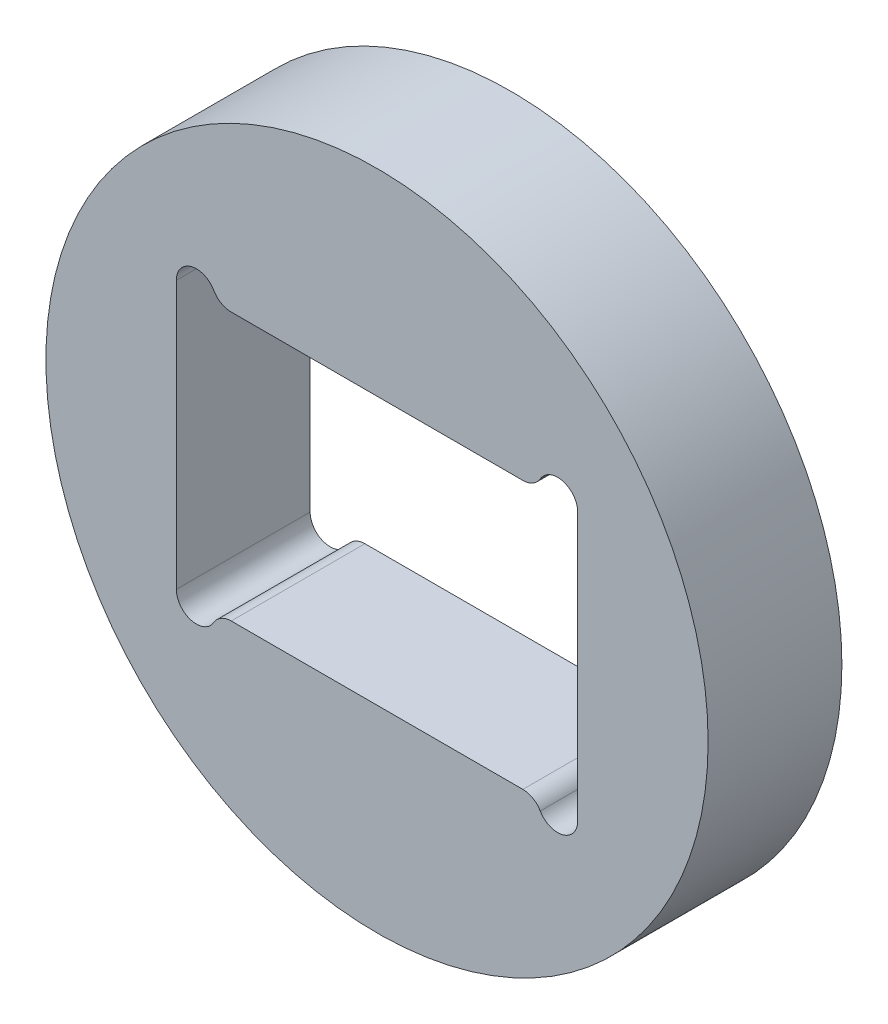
ISO-10303-21;
HEADER;
FILE_DESCRIPTION(('STEP AP214'),'2;1');
FILE_NAME('part.step','',(''),(''),'','','');
FILE_SCHEMA(('AUTOMOTIVE_DESIGN { 1 0 10303 214 1 1 1 1 }'));
ENDSEC;
DATA;
#1=APPLICATION_CONTEXT('core data for automotive mechanical design processes');
#2=APPLICATION_PROTOCOL_DEFINITION('international standard','automotive_design',2000,#1);
#3=PRODUCT_CONTEXT('',#1,'mechanical');
#4=PRODUCT('Part','Part','',(#3));
#5=PRODUCT_RELATED_PRODUCT_CATEGORY('part','',(#4));
#6=PRODUCT_DEFINITION_FORMATION('','',#4);
#7=PRODUCT_DEFINITION_CONTEXT('part definition',#1,'design');
#8=PRODUCT_DEFINITION('design','',#6,#7);
#9=PRODUCT_DEFINITION_SHAPE('','',#8);
#10=(LENGTH_UNIT() NAMED_UNIT(*) SI_UNIT(.MILLI.,.METRE.));
#11=(NAMED_UNIT(*) PLANE_ANGLE_UNIT() SI_UNIT($,.RADIAN.));
#12=(NAMED_UNIT(*) SI_UNIT($,.STERADIAN.) SOLID_ANGLE_UNIT());
#13=UNCERTAINTY_MEASURE_WITH_UNIT(LENGTH_MEASURE(1.E-05),#10,'distance_accuracy_value','');
#14=(GEOMETRIC_REPRESENTATION_CONTEXT(3) GLOBAL_UNCERTAINTY_ASSIGNED_CONTEXT((#13)) GLOBAL_UNIT_ASSIGNED_CONTEXT((#10,
#11,#12)) REPRESENTATION_CONTEXT('',''));
#15=CARTESIAN_POINT('',(0.,0.,0.));
#16=DIRECTION('',(0.,0.,1.));
#17=DIRECTION('',(1.,0.,0.));
#18=AXIS2_PLACEMENT_3D('',#15,#16,#17);
#19=CARTESIAN_POINT('',(0.,0.,10.));
#20=DIRECTION('',(0.,0.,1.));
#21=DIRECTION('',(1.,0.,0.));
#22=AXIS2_PLACEMENT_3D('',#19,#20,#21);
#23=PLANE('',#22);
#24=CARTESIAN_POINT('',(0.,0.,10.));
#25=DIRECTION('',(0.,0.,1.));
#26=DIRECTION('',(1.,0.,0.));
#27=AXIS2_PLACEMENT_3D('',#24,#25,#26);
#28=CIRCLE('',#27,24.75);
#29=CARTESIAN_POINT('',(24.75,0.,10.));
#30=VERTEX_POINT('',#29);
#31=EDGE_CURVE('E11',#30,#30,#28,.T.);
#32=ORIENTED_EDGE('',*,*,#31,.T.);
#33=EDGE_LOOP('',(#32));
#34=FACE_BOUND('',#33,.T.);
#35=DIRECTION('',(0.,-1.,0.));
#36=VECTOR('',#35,1.);
#37=CARTESIAN_POINT('',(-15.,-10.0000000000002,10.));
#38=LINE('',#37,#36);
#39=CARTESIAN_POINT('',(-15.,10.,10.));
#40=VERTEX_POINT('',#39);
#41=CARTESIAN_POINT('',(-15.,-10.0000000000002,10.));
#42=VERTEX_POINT('',#41);
#43=EDGE_CURVE('E144',#40,#42,#38,.T.);
#44=ORIENTED_EDGE('',*,*,#43,.F.);
#45=CARTESIAN_POINT('',(-13.5,10.,10.));
#46=DIRECTION('',(0.,0.,1.));
#47=DIRECTION('',(1.,0.,0.));
#48=AXIS2_PLACEMENT_3D('',#45,#46,#47);
#49=CIRCLE('',#48,1.5);
#50=CARTESIAN_POINT('',(-12.2009618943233,10.75,10.));
#51=VERTEX_POINT('',#50);
#52=EDGE_CURVE('E135',#51,#40,#49,.T.);
#53=ORIENTED_EDGE('',*,*,#52,.F.);
#54=CARTESIAN_POINT('',(-10.9019237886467,11.5,10.));
#55=DIRECTION('',(0.,0.,-1.));
#56=DIRECTION('',(1.,0.,0.));
#57=AXIS2_PLACEMENT_3D('',#54,#55,#56);
#58=CIRCLE('',#57,1.5);
#59=CARTESIAN_POINT('',(-10.9019237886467,10.,10.));
#60=VERTEX_POINT('',#59);
#61=EDGE_CURVE('E187',#60,#51,#58,.T.);
#62=ORIENTED_EDGE('',*,*,#61,.F.);
#63=DIRECTION('',(-1.,0.,0.));
#64=VECTOR('',#63,1.);
#65=CARTESIAN_POINT('',(-10.9019237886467,10.,10.));
#66=LINE('',#65,#64);
#67=CARTESIAN_POINT('',(10.9019237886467,10.,10.));
#68=VERTEX_POINT('',#67);
#69=EDGE_CURVE('E184',#68,#60,#66,.T.);
#70=ORIENTED_EDGE('',*,*,#69,.F.);
#71=CARTESIAN_POINT('',(10.9019237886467,11.5,10.));
#72=DIRECTION('',(0.,0.,-1.));
#73=DIRECTION('',(1.,0.,0.));
#74=AXIS2_PLACEMENT_3D('',#71,#72,#73);
#75=CIRCLE('',#74,1.5);
#76=CARTESIAN_POINT('',(12.2009618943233,10.75,10.));
#77=VERTEX_POINT('',#76);
#78=EDGE_CURVE('E181',#77,#68,#75,.T.);
#79=ORIENTED_EDGE('',*,*,#78,.F.);
#80=CARTESIAN_POINT('',(13.5,10.,10.));
#81=DIRECTION('',(0.,0.,1.));
#82=DIRECTION('',(1.,0.,0.));
#83=AXIS2_PLACEMENT_3D('',#80,#81,#82);
#84=CIRCLE('',#83,1.5);
#85=CARTESIAN_POINT('',(15.,10.,10.));
#86=VERTEX_POINT('',#85);
#87=EDGE_CURVE('E178',#86,#77,#84,.T.);
#88=ORIENTED_EDGE('',*,*,#87,.F.);
#89=DIRECTION('',(0.,1.,0.));
#90=VECTOR('',#89,1.);
#91=CARTESIAN_POINT('',(15.,10.,10.));
#92=LINE('',#91,#90);
#93=CARTESIAN_POINT('',(15.,-10.0000000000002,10.));
#94=VERTEX_POINT('',#93);
#95=EDGE_CURVE('E175',#94,#86,#92,.T.);
#96=ORIENTED_EDGE('',*,*,#95,.F.);
#97=CARTESIAN_POINT('',(13.5,-10.0000000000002,10.));
#98=DIRECTION('',(0.,0.,1.));
#99=DIRECTION('',(1.,0.,0.));
#100=AXIS2_PLACEMENT_3D('',#97,#98,#99);
#101=CIRCLE('',#100,1.5);
#102=CARTESIAN_POINT('',(12.2009618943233,-10.7500000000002,10.));
#103=VERTEX_POINT('',#102);
#104=EDGE_CURVE('E172',#103,#94,#101,.T.);
#105=ORIENTED_EDGE('',*,*,#104,.F.);
#106=CARTESIAN_POINT('',(10.9019237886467,-11.5000000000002,10.));
#107=DIRECTION('',(0.,0.,-1.));
#108=DIRECTION('',(1.,0.,0.));
#109=AXIS2_PLACEMENT_3D('',#106,#107,#108);
#110=CIRCLE('',#109,1.5);
#111=CARTESIAN_POINT('',(10.9019237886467,-10.0000000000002,10.));
#112=VERTEX_POINT('',#111);
#113=EDGE_CURVE('E169',#112,#103,#110,.T.);
#114=ORIENTED_EDGE('',*,*,#113,.F.);
#115=DIRECTION('',(1.,0.,0.));
#116=VECTOR('',#115,1.);
#117=CARTESIAN_POINT('',(10.9019237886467,-10.0000000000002,10.));
#118=LINE('',#117,#116);
#119=CARTESIAN_POINT('',(-10.9019237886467,-10.0000000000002,10.));
#120=VERTEX_POINT('',#119);
#121=EDGE_CURVE('E166',#120,#112,#118,.T.);
#122=ORIENTED_EDGE('',*,*,#121,.F.);
#123=CARTESIAN_POINT('',(-10.9019237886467,-11.5000000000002,10.));
#124=DIRECTION('',(0.,0.,-1.));
#125=DIRECTION('',(1.,0.,0.));
#126=AXIS2_PLACEMENT_3D('',#123,#124,#125);
#127=CIRCLE('',#126,1.5);
#128=CARTESIAN_POINT('',(-12.2009618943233,-10.7500000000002,10.));
#129=VERTEX_POINT('',#128);
#130=EDGE_CURVE('E161',#129,#120,#127,.T.);
#131=ORIENTED_EDGE('',*,*,#130,.F.);
#132=CARTESIAN_POINT('',(-13.5,-10.0000000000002,10.));
#133=DIRECTION('',(0.,0.,1.));
#134=DIRECTION('',(1.,0.,0.));
#135=AXIS2_PLACEMENT_3D('',#132,#133,#134);
#136=CIRCLE('',#135,1.5);
#137=EDGE_CURVE('E157',#42,#129,#136,.T.);
#138=ORIENTED_EDGE('',*,*,#137,.F.);
#139=EDGE_LOOP('',(#44,#53,#62,#70,#79,#88,#96,#105,#114,#122,#131,#138));
#140=FACE_BOUND('',#139,.T.);
#141=ADVANCED_FACE('F45',(#34,#140),#23,.T.);
#142=CARTESIAN_POINT('',(0.,0.,0.));
#143=DIRECTION('',(0.,0.,1.));
#144=DIRECTION('',(1.,0.,0.));
#145=AXIS2_PLACEMENT_3D('',#142,#143,#144);
#146=PLANE('',#145);
#147=CARTESIAN_POINT('',(0.,0.,0.));
#148=DIRECTION('',(0.,0.,1.));
#149=DIRECTION('',(1.,0.,0.));
#150=AXIS2_PLACEMENT_3D('',#147,#148,#149);
#151=CIRCLE('',#150,24.75);
#152=CARTESIAN_POINT('',(24.75,0.,0.));
#153=VERTEX_POINT('',#152);
#154=EDGE_CURVE('E49',#153,#153,#151,.T.);
#155=ORIENTED_EDGE('',*,*,#154,.F.);
#156=EDGE_LOOP('',(#155));
#157=FACE_BOUND('',#156,.T.);
#158=CARTESIAN_POINT('',(-13.5,10.,0.));
#159=DIRECTION('',(0.,0.,1.));
#160=DIRECTION('',(1.,0.,0.));
#161=AXIS2_PLACEMENT_3D('',#158,#159,#160);
#162=CIRCLE('',#161,1.5);
#163=CARTESIAN_POINT('',(-12.2009618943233,10.75,0.));
#164=VERTEX_POINT('',#163);
#165=CARTESIAN_POINT('',(-15.,10.,0.));
#166=VERTEX_POINT('',#165);
#167=EDGE_CURVE('E69',#164,#166,#162,.T.);
#168=ORIENTED_EDGE('',*,*,#167,.T.);
#169=DIRECTION('',(0.,-1.,0.));
#170=VECTOR('',#169,1.);
#171=CARTESIAN_POINT('',(-15.,-10.0000000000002,0.));
#172=LINE('',#171,#170);
#173=CARTESIAN_POINT('',(-15.,-10.0000000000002,0.));
#174=VERTEX_POINT('',#173);
#175=EDGE_CURVE('E151',#166,#174,#172,.T.);
#176=ORIENTED_EDGE('',*,*,#175,.T.);
#177=CARTESIAN_POINT('',(-13.5,-10.0000000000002,0.));
#178=DIRECTION('',(0.,0.,1.));
#179=DIRECTION('',(1.,0.,0.));
#180=AXIS2_PLACEMENT_3D('',#177,#178,#179);
#181=CIRCLE('',#180,1.5);
#182=CARTESIAN_POINT('',(-12.2009618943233,-10.7500000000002,0.));
#183=VERTEX_POINT('',#182);
#184=EDGE_CURVE('E194',#174,#183,#181,.T.);
#185=ORIENTED_EDGE('',*,*,#184,.T.);
#186=CARTESIAN_POINT('',(-10.9019237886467,-11.5000000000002,0.));
#187=DIRECTION('',(0.,0.,-1.));
#188=DIRECTION('',(1.,0.,0.));
#189=AXIS2_PLACEMENT_3D('',#186,#187,#188);
#190=CIRCLE('',#189,1.5);
#191=CARTESIAN_POINT('',(-10.9019237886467,-10.0000000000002,0.));
#192=VERTEX_POINT('',#191);
#193=EDGE_CURVE('E198',#183,#192,#190,.T.);
#194=ORIENTED_EDGE('',*,*,#193,.T.);
#195=DIRECTION('',(1.,0.,0.));
#196=VECTOR('',#195,1.);
#197=CARTESIAN_POINT('',(10.9019237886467,-10.0000000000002,0.));
#198=LINE('',#197,#196);
#199=CARTESIAN_POINT('',(10.9019237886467,-10.0000000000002,0.));
#200=VERTEX_POINT('',#199);
#201=EDGE_CURVE('E202',#192,#200,#198,.T.);
#202=ORIENTED_EDGE('',*,*,#201,.T.);
#203=CARTESIAN_POINT('',(10.9019237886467,-11.5000000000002,0.));
#204=DIRECTION('',(0.,0.,-1.));
#205=DIRECTION('',(1.,0.,0.));
#206=AXIS2_PLACEMENT_3D('',#203,#204,#205);
#207=CIRCLE('',#206,1.5);
#208=CARTESIAN_POINT('',(12.2009618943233,-10.7500000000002,0.));
#209=VERTEX_POINT('',#208);
#210=EDGE_CURVE('E206',#200,#209,#207,.T.);
#211=ORIENTED_EDGE('',*,*,#210,.T.);
#212=CARTESIAN_POINT('',(13.5,-10.0000000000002,0.));
#213=DIRECTION('',(0.,0.,1.));
#214=DIRECTION('',(1.,0.,0.));
#215=AXIS2_PLACEMENT_3D('',#212,#213,#214);
#216=CIRCLE('',#215,1.5);
#217=CARTESIAN_POINT('',(15.,-10.0000000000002,0.));
#218=VERTEX_POINT('',#217);
#219=EDGE_CURVE('E210',#209,#218,#216,.T.);
#220=ORIENTED_EDGE('',*,*,#219,.T.);
#221=DIRECTION('',(0.,1.,0.));
#222=VECTOR('',#221,1.);
#223=CARTESIAN_POINT('',(15.,10.,0.));
#224=LINE('',#223,#222);
#225=CARTESIAN_POINT('',(15.,10.,0.));
#226=VERTEX_POINT('',#225);
#227=EDGE_CURVE('E214',#218,#226,#224,.T.);
#228=ORIENTED_EDGE('',*,*,#227,.T.);
#229=CARTESIAN_POINT('',(13.5,10.,0.));
#230=DIRECTION('',(0.,0.,1.));
#231=DIRECTION('',(1.,0.,0.));
#232=AXIS2_PLACEMENT_3D('',#229,#230,#231);
#233=CIRCLE('',#232,1.5);
#234=CARTESIAN_POINT('',(12.2009618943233,10.75,0.));
#235=VERTEX_POINT('',#234);
#236=EDGE_CURVE('E218',#226,#235,#233,.T.);
#237=ORIENTED_EDGE('',*,*,#236,.T.);
#238=CARTESIAN_POINT('',(10.9019237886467,11.5,0.));
#239=DIRECTION('',(0.,0.,-1.));
#240=DIRECTION('',(1.,0.,0.));
#241=AXIS2_PLACEMENT_3D('',#238,#239,#240);
#242=CIRCLE('',#241,1.5);
#243=CARTESIAN_POINT('',(10.9019237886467,10.,0.));
#244=VERTEX_POINT('',#243);
#245=EDGE_CURVE('E222',#235,#244,#242,.T.);
#246=ORIENTED_EDGE('',*,*,#245,.T.);
#247=DIRECTION('',(-1.,0.,0.));
#248=VECTOR('',#247,1.);
#249=CARTESIAN_POINT('',(-10.9019237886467,10.,0.));
#250=LINE('',#249,#248);
#251=CARTESIAN_POINT('',(-10.9019237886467,10.,0.));
#252=VERTEX_POINT('',#251);
#253=EDGE_CURVE('E226',#244,#252,#250,.T.);
#254=ORIENTED_EDGE('',*,*,#253,.T.);
#255=CARTESIAN_POINT('',(-10.9019237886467,11.5,0.));
#256=DIRECTION('',(0.,0.,-1.));
#257=DIRECTION('',(1.,0.,0.));
#258=AXIS2_PLACEMENT_3D('',#255,#256,#257);
#259=CIRCLE('',#258,1.5);
#260=EDGE_CURVE('E145',#252,#164,#259,.T.);
#261=ORIENTED_EDGE('',*,*,#260,.T.);
#262=EDGE_LOOP('',(#168,#176,#185,#194,#202,#211,#220,#228,#237,#246,#254,#261));
#263=FACE_BOUND('',#262,.T.);
#264=ADVANCED_FACE('F268',(#157,#263),#146,.F.);
#265=CARTESIAN_POINT('',(0.,0.,10.));
#266=DIRECTION('',(0.,0.,-1.));
#267=DIRECTION('',(-1.,0.,0.));
#268=AXIS2_PLACEMENT_3D('',#265,#266,#267);
#269=CYLINDRICAL_SURFACE('',#268,24.75);
#270=ORIENTED_EDGE('',*,*,#31,.F.);
#271=EDGE_LOOP('',(#270));
#272=FACE_BOUND('',#271,.T.);
#273=ORIENTED_EDGE('',*,*,#154,.T.);
#274=EDGE_LOOP('',(#273));
#275=FACE_BOUND('',#274,.T.);
#276=ADVANCED_FACE('F47',(#272,#275),#269,.T.);
#277=CARTESIAN_POINT('',(-13.5,10.,10.));
#278=DIRECTION('',(0.,0.,-1.));
#279=DIRECTION('',(-1.,0.,0.));
#280=AXIS2_PLACEMENT_3D('',#277,#278,#279);
#281=CYLINDRICAL_SURFACE('',#280,1.5);
#282=ORIENTED_EDGE('',*,*,#167,.F.);
#283=DIRECTION('',(0.,0.,-1.));
#284=VECTOR('',#283,1.);
#285=CARTESIAN_POINT('',(-12.2009618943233,10.75,10.));
#286=LINE('',#285,#284);
#287=EDGE_CURVE('E139',#51,#164,#286,.T.);
#288=ORIENTED_EDGE('',*,*,#287,.F.);
#289=ORIENTED_EDGE('',*,*,#52,.T.);
#290=DIRECTION('',(0.,0.,-1.));
#291=VECTOR('',#290,1.);
#292=CARTESIAN_POINT('',(-15.,10.,10.));
#293=LINE('',#292,#291);
#294=EDGE_CURVE('E138',#40,#166,#293,.T.);
#295=ORIENTED_EDGE('',*,*,#294,.T.);
#296=EDGE_LOOP('',(#282,#288,#289,#295));
#297=FACE_BOUND('',#296,.T.);
#298=ADVANCED_FACE('F137',(#297),#281,.F.);
#299=CARTESIAN_POINT('',(-15.,-10.0000000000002,10.));
#300=DIRECTION('',(1.,0.,0.));
#301=DIRECTION('',(0.,0.,-1.));
#302=AXIS2_PLACEMENT_3D('',#299,#300,#301);
#303=PLANE('',#302);
#304=ORIENTED_EDGE('',*,*,#175,.F.);
#305=ORIENTED_EDGE('',*,*,#294,.F.);
#306=ORIENTED_EDGE('',*,*,#43,.T.);
#307=DIRECTION('',(0.,0.,-1.));
#308=VECTOR('',#307,1.);
#309=CARTESIAN_POINT('',(-15.,-10.0000000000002,10.));
#310=LINE('',#309,#308);
#311=EDGE_CURVE('E153',#42,#174,#310,.T.);
#312=ORIENTED_EDGE('',*,*,#311,.T.);
#313=EDGE_LOOP('',(#304,#305,#306,#312));
#314=FACE_BOUND('',#313,.T.);
#315=ADVANCED_FACE('F148',(#314),#303,.T.);
#316=CARTESIAN_POINT('',(-13.5,-10.0000000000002,10.));
#317=DIRECTION('',(0.,0.,-1.));
#318=DIRECTION('',(-1.,0.,0.));
#319=AXIS2_PLACEMENT_3D('',#316,#317,#318);
#320=CYLINDRICAL_SURFACE('',#319,1.5);
#321=ORIENTED_EDGE('',*,*,#184,.F.);
#322=ORIENTED_EDGE('',*,*,#311,.F.);
#323=ORIENTED_EDGE('',*,*,#137,.T.);
#324=DIRECTION('',(0.,0.,-1.));
#325=VECTOR('',#324,1.);
#326=CARTESIAN_POINT('',(-12.2009618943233,-10.7500000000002,10.));
#327=LINE('',#326,#325);
#328=EDGE_CURVE('E258',#129,#183,#327,.T.);
#329=ORIENTED_EDGE('',*,*,#328,.T.);
#330=EDGE_LOOP('',(#321,#322,#323,#329));
#331=FACE_BOUND('',#330,.T.);
#332=ADVANCED_FACE('F264',(#331),#320,.F.);
#333=CARTESIAN_POINT('',(-10.9019237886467,-11.5000000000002,10.));
#334=DIRECTION('',(0.,0.,-1.));
#335=DIRECTION('',(-1.,0.,0.));
#336=AXIS2_PLACEMENT_3D('',#333,#334,#335);
#337=CYLINDRICAL_SURFACE('',#336,1.5);
#338=ORIENTED_EDGE('',*,*,#193,.F.);
#339=ORIENTED_EDGE('',*,*,#328,.F.);
#340=ORIENTED_EDGE('',*,*,#130,.T.);
#341=DIRECTION('',(0.,0.,-1.));
#342=VECTOR('',#341,1.);
#343=CARTESIAN_POINT('',(-10.9019237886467,-10.0000000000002,10.));
#344=LINE('',#343,#342);
#345=EDGE_CURVE('E255',#120,#192,#344,.T.);
#346=ORIENTED_EDGE('',*,*,#345,.T.);
#347=EDGE_LOOP('',(#338,#339,#340,#346));
#348=FACE_BOUND('',#347,.T.);
#349=ADVANCED_FACE('F306',(#348),#337,.T.);
#350=CARTESIAN_POINT('',(10.9019237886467,-10.0000000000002,10.));
#351=DIRECTION('',(0.,1.,0.));
#352=DIRECTION('',(-1.,0.,0.));
#353=AXIS2_PLACEMENT_3D('',#350,#351,#352);
#354=PLANE('',#353);
#355=ORIENTED_EDGE('',*,*,#201,.F.);
#356=ORIENTED_EDGE('',*,*,#345,.F.);
#357=ORIENTED_EDGE('',*,*,#121,.T.);
#358=DIRECTION('',(0.,0.,-1.));
#359=VECTOR('',#358,1.);
#360=CARTESIAN_POINT('',(10.9019237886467,-10.0000000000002,10.));
#361=LINE('',#360,#359);
#362=EDGE_CURVE('E252',#112,#200,#361,.T.);
#363=ORIENTED_EDGE('',*,*,#362,.T.);
#364=EDGE_LOOP('',(#355,#356,#357,#363));
#365=FACE_BOUND('',#364,.T.);
#366=ADVANCED_FACE('F304',(#365),#354,.T.);
#367=CARTESIAN_POINT('',(10.9019237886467,-11.5000000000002,10.));
#368=DIRECTION('',(0.,0.,-1.));
#369=DIRECTION('',(-1.,0.,0.));
#370=AXIS2_PLACEMENT_3D('',#367,#368,#369);
#371=CYLINDRICAL_SURFACE('',#370,1.5);
#372=ORIENTED_EDGE('',*,*,#210,.F.);
#373=ORIENTED_EDGE('',*,*,#362,.F.);
#374=ORIENTED_EDGE('',*,*,#113,.T.);
#375=DIRECTION('',(0.,0.,-1.));
#376=VECTOR('',#375,1.);
#377=CARTESIAN_POINT('',(12.2009618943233,-10.7500000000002,10.));
#378=LINE('',#377,#376);
#379=EDGE_CURVE('E249',#103,#209,#378,.T.);
#380=ORIENTED_EDGE('',*,*,#379,.T.);
#381=EDGE_LOOP('',(#372,#373,#374,#380));
#382=FACE_BOUND('',#381,.T.);
#383=ADVANCED_FACE('F298',(#382),#371,.T.);
#384=CARTESIAN_POINT('',(13.5,-10.0000000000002,10.));
#385=DIRECTION('',(0.,0.,-1.));
#386=DIRECTION('',(-1.,0.,0.));
#387=AXIS2_PLACEMENT_3D('',#384,#385,#386);
#388=CYLINDRICAL_SURFACE('',#387,1.5);
#389=ORIENTED_EDGE('',*,*,#219,.F.);
#390=ORIENTED_EDGE('',*,*,#379,.F.);
#391=ORIENTED_EDGE('',*,*,#104,.T.);
#392=DIRECTION('',(0.,0.,-1.));
#393=VECTOR('',#392,1.);
#394=CARTESIAN_POINT('',(15.,-10.0000000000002,10.));
#395=LINE('',#394,#393);
#396=EDGE_CURVE('E246',#94,#218,#395,.T.);
#397=ORIENTED_EDGE('',*,*,#396,.T.);
#398=EDGE_LOOP('',(#389,#390,#391,#397));
#399=FACE_BOUND('',#398,.T.);
#400=ADVANCED_FACE('F294',(#399),#388,.F.);
#401=CARTESIAN_POINT('',(15.,10.,10.));
#402=DIRECTION('',(-1.,0.,0.));
#403=DIRECTION('',(0.,-1.,0.));
#404=AXIS2_PLACEMENT_3D('',#401,#402,#403);
#405=PLANE('',#404);
#406=ORIENTED_EDGE('',*,*,#227,.F.);
#407=ORIENTED_EDGE('',*,*,#396,.F.);
#408=ORIENTED_EDGE('',*,*,#95,.T.);
#409=DIRECTION('',(0.,0.,-1.));
#410=VECTOR('',#409,1.);
#411=CARTESIAN_POINT('',(15.,10.,10.));
#412=LINE('',#411,#410);
#413=EDGE_CURVE('E243',#86,#226,#412,.T.);
#414=ORIENTED_EDGE('',*,*,#413,.T.);
#415=EDGE_LOOP('',(#406,#407,#408,#414));
#416=FACE_BOUND('',#415,.T.);
#417=ADVANCED_FACE('F291',(#416),#405,.T.);
#418=CARTESIAN_POINT('',(13.5,10.,10.));
#419=DIRECTION('',(0.,0.,-1.));
#420=DIRECTION('',(-1.,0.,0.));
#421=AXIS2_PLACEMENT_3D('',#418,#419,#420);
#422=CYLINDRICAL_SURFACE('',#421,1.5);
#423=ORIENTED_EDGE('',*,*,#236,.F.);
#424=ORIENTED_EDGE('',*,*,#413,.F.);
#425=ORIENTED_EDGE('',*,*,#87,.T.);
#426=DIRECTION('',(0.,0.,-1.));
#427=VECTOR('',#426,1.);
#428=CARTESIAN_POINT('',(12.2009618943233,10.75,10.));
#429=LINE('',#428,#427);
#430=EDGE_CURVE('E240',#77,#235,#429,.T.);
#431=ORIENTED_EDGE('',*,*,#430,.T.);
#432=EDGE_LOOP('',(#423,#424,#425,#431));
#433=FACE_BOUND('',#432,.T.);
#434=ADVANCED_FACE('F283',(#433),#422,.F.);
#435=CARTESIAN_POINT('',(10.9019237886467,11.5,10.));
#436=DIRECTION('',(0.,0.,-1.));
#437=DIRECTION('',(-1.,0.,0.));
#438=AXIS2_PLACEMENT_3D('',#435,#436,#437);
#439=CYLINDRICAL_SURFACE('',#438,1.5);
#440=ORIENTED_EDGE('',*,*,#245,.F.);
#441=ORIENTED_EDGE('',*,*,#430,.F.);
#442=ORIENTED_EDGE('',*,*,#78,.T.);
#443=DIRECTION('',(0.,0.,-1.));
#444=VECTOR('',#443,1.);
#445=CARTESIAN_POINT('',(10.9019237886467,10.,10.));
#446=LINE('',#445,#444);
#447=EDGE_CURVE('E237',#68,#244,#446,.T.);
#448=ORIENTED_EDGE('',*,*,#447,.T.);
#449=EDGE_LOOP('',(#440,#441,#442,#448));
#450=FACE_BOUND('',#449,.T.);
#451=ADVANCED_FACE('F279',(#450),#439,.T.);
#452=CARTESIAN_POINT('',(-10.9019237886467,10.,10.));
#453=DIRECTION('',(0.,-1.,0.));
#454=DIRECTION('',(1.,0.,0.));
#455=AXIS2_PLACEMENT_3D('',#452,#453,#454);
#456=PLANE('',#455);
#457=ORIENTED_EDGE('',*,*,#253,.F.);
#458=ORIENTED_EDGE('',*,*,#447,.F.);
#459=ORIENTED_EDGE('',*,*,#69,.T.);
#460=DIRECTION('',(0.,0.,-1.));
#461=VECTOR('',#460,1.);
#462=CARTESIAN_POINT('',(-10.9019237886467,10.,10.));
#463=LINE('',#462,#461);
#464=EDGE_CURVE('E61',#60,#252,#463,.T.);
#465=ORIENTED_EDGE('',*,*,#464,.T.);
#466=EDGE_LOOP('',(#457,#458,#459,#465));
#467=FACE_BOUND('',#466,.T.);
#468=ADVANCED_FACE('F276',(#467),#456,.T.);
#469=CARTESIAN_POINT('',(-10.9019237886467,11.5,10.));
#470=DIRECTION('',(0.,0.,-1.));
#471=DIRECTION('',(-1.,0.,0.));
#472=AXIS2_PLACEMENT_3D('',#469,#470,#471);
#473=CYLINDRICAL_SURFACE('',#472,1.5);
#474=ORIENTED_EDGE('',*,*,#260,.F.);
#475=ORIENTED_EDGE('',*,*,#464,.F.);
#476=ORIENTED_EDGE('',*,*,#61,.T.);
#477=ORIENTED_EDGE('',*,*,#287,.T.);
#478=EDGE_LOOP('',(#474,#475,#476,#477));
#479=FACE_BOUND('',#478,.T.);
#480=ADVANCED_FACE('F270',(#479),#473,.T.);
#481=CLOSED_SHELL('',(#141,#264,#276,#298,#315,#332,#349,#366,#383,#400,#417,#434,#451,#468,#480));
#482=MANIFOLD_SOLID_BREP('B2',#481);
#483=ADVANCED_BREP_SHAPE_REPRESENTATION('',(#18,#482),#14);
#484=SHAPE_DEFINITION_REPRESENTATION(#9,#483);
ENDSEC;
END-ISO-10303-21;
